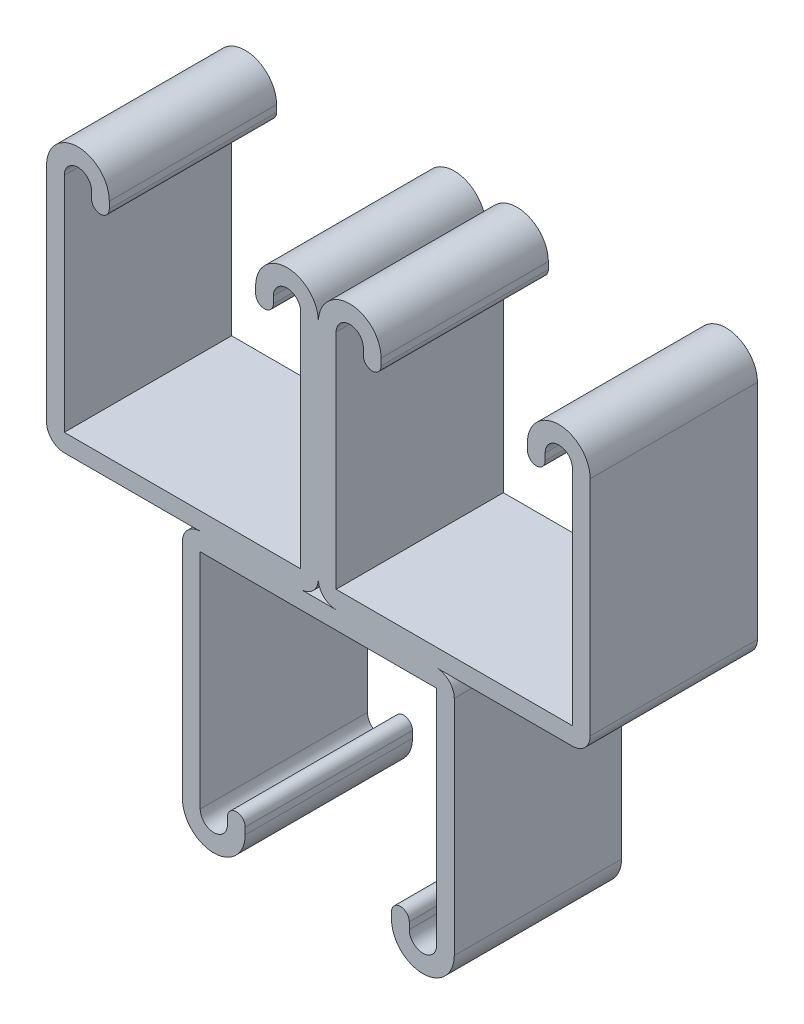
from build123d import *

# Parameters (mm, degrees)
BASE_EXTRUDE_DEPTH = 12.7
CIRPATTERN1_COUNT  = 2
LPATTERN1_COUNT    = 2
LPATTERN1_PITCH    = 41.275


with BuildPart() as part:
    # Sketch1 → Base-Extrude (new, symmetric)
    with BuildSketch(Plane.XY):
        with BuildLine():
            Line((-30.95625, 36.5125), (-30.95625, 2.6924))
            ThreePointArc((-30.95625, 2.6924), (-30.167664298, 0.788585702), (-28.26385, 0))
            Line((-28.26385, 0), (7.62635, 0))
            ThreePointArc((7.62635, 0), (9.530164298, 0.788585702), (10.31875, 2.6924))
            Line((10.31875, 2.6924), (10.31875, 36.5125))
            ThreePointArc((10.31875, 36.5125), (5.55625, 41.275), (0.79375, 36.5125))
            Line((0.79375, 36.5125), (0.79375, 35.47745))
            ThreePointArc((0.79375, 35.47745), (2.13995, 34.13125), (3.48615, 35.47745))
            Line((3.48615, 35.47745), (3.48615, 36.5125))
            ThreePointArc((3.48615, 36.5125), (5.55625, 38.5826), (7.62635, 36.5125))
            Line((7.62635, 36.5125), (7.62635, 2.6924))
            Line((7.62635, 2.6924), (-28.26385, 2.6924))
            Line((-28.26385, 2.6924), (-28.26385, 36.5125))
            ThreePointArc((-28.26385, 36.5125), (-26.19375, 38.5826), (-24.12365, 36.5125))
            Line((-24.12365, 36.5125), (-24.12365, 35.47745))
            ThreePointArc((-24.12365, 35.47745), (-22.77745, 34.13125), (-21.43125, 35.47745))
            Line((-21.43125, 35.47745), (-21.43125, 36.5125))
            ThreePointArc((-21.43125, 36.5125), (-26.19375, 41.275), (-30.95625, 36.5125))
        make_face()
    base_extrude = extrude(amount=BASE_EXTRUDE_DEPTH, both=True)

    # CirPattern1: Base-Extrude ×2 about axis
    cirpattern1_axis = Axis((0, 0, 0), (0, 0, 1))
    for i in range(1, CIRPATTERN1_COUNT):
        add(base_extrude.rotate(cirpattern1_axis, i * 360 / CIRPATTERN1_COUNT))

    # LPattern1: Base-Extrude ×2
    with Locations(*[(i * LPATTERN1_PITCH, 0, 0) for i in range(1, LPATTERN1_COUNT)]):
        add(base_extrude)


solid = part.part
